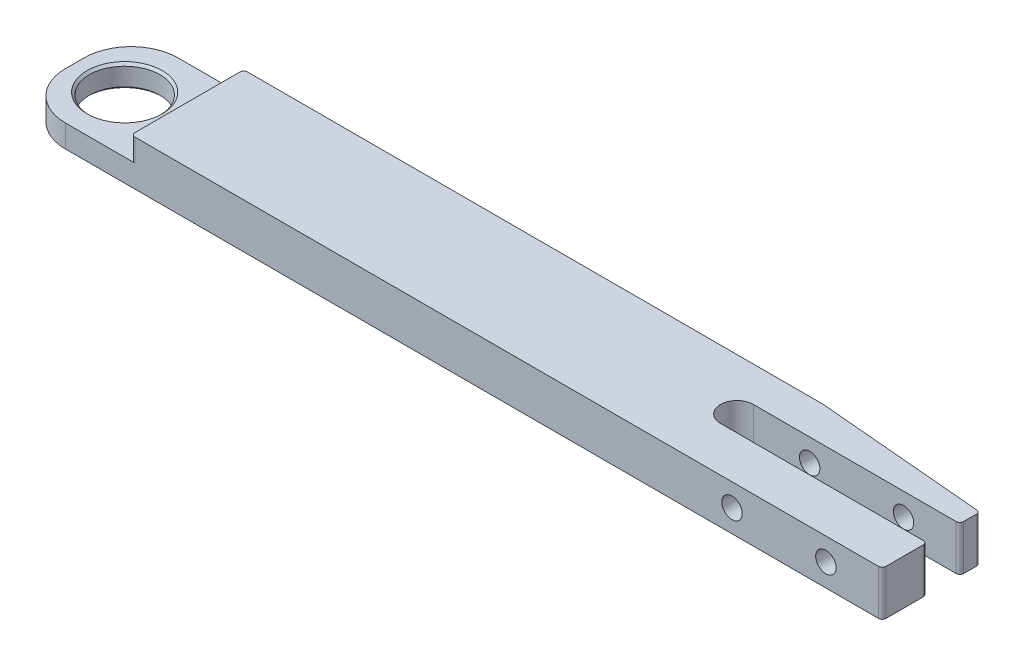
ISO-10303-21;
HEADER;
FILE_DESCRIPTION(('STEP AP214'),'2;1');
FILE_NAME('part.step','',(''),(''),'','','');
FILE_SCHEMA(('AUTOMOTIVE_DESIGN { 1 0 10303 214 1 1 1 1 }'));
ENDSEC;
DATA;
#1=APPLICATION_CONTEXT('core data for automotive mechanical design processes');
#2=APPLICATION_PROTOCOL_DEFINITION('international standard','automotive_design',2000,#1);
#3=PRODUCT_CONTEXT('',#1,'mechanical');
#4=PRODUCT('Part','Part','',(#3));
#5=PRODUCT_RELATED_PRODUCT_CATEGORY('part','',(#4));
#6=PRODUCT_DEFINITION_FORMATION('','',#4);
#7=PRODUCT_DEFINITION_CONTEXT('part definition',#1,'design');
#8=PRODUCT_DEFINITION('design','',#6,#7);
#9=PRODUCT_DEFINITION_SHAPE('','',#8);
#10=(LENGTH_UNIT() NAMED_UNIT(*) SI_UNIT(.MILLI.,.METRE.));
#11=(NAMED_UNIT(*) PLANE_ANGLE_UNIT() SI_UNIT($,.RADIAN.));
#12=(NAMED_UNIT(*) SI_UNIT($,.STERADIAN.) SOLID_ANGLE_UNIT());
#13=UNCERTAINTY_MEASURE_WITH_UNIT(LENGTH_MEASURE(1.E-05),#10,'distance_accuracy_value','');
#14=(GEOMETRIC_REPRESENTATION_CONTEXT(3) GLOBAL_UNCERTAINTY_ASSIGNED_CONTEXT((#13)) GLOBAL_UNIT_ASSIGNED_CONTEXT((#10,
#11,#12)) REPRESENTATION_CONTEXT('',''));
#15=CARTESIAN_POINT('',(0.,0.,0.));
#16=DIRECTION('',(0.,0.,1.));
#17=DIRECTION('',(1.,0.,0.));
#18=AXIS2_PLACEMENT_3D('',#15,#16,#17);
#19=CARTESIAN_POINT('',(73.025,3.81,-9.525));
#20=DIRECTION('',(-1.,0.,0.));
#21=DIRECTION('',(0.,0.,1.));
#22=AXIS2_PLACEMENT_3D('',#19,#20,#21);
#23=PLANE('',#22);
#24=DIRECTION('',(0.,0.,-1.));
#25=VECTOR('',#24,1.);
#26=CARTESIAN_POINT('',(73.025,-3.81,-9.525));
#27=LINE('',#26,#25);
#28=CARTESIAN_POINT('',(73.025,-3.81,8.88999999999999));
#29=VERTEX_POINT('',#28);
#30=CARTESIAN_POINT('',(73.025,-3.81,2.58762500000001));
#31=VERTEX_POINT('',#30);
#32=EDGE_CURVE('E237',#29,#31,#27,.T.);
#33=ORIENTED_EDGE('',*,*,#32,.T.);
#34=DIRECTION('',(0.,-1.,0.));
#35=VECTOR('',#34,1.);
#36=CARTESIAN_POINT('',(73.025,3.81,2.58762500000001));
#37=LINE('',#36,#35);
#38=CARTESIAN_POINT('',(73.025,3.81,2.58762500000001));
#39=VERTEX_POINT('',#38);
#40=EDGE_CURVE('E306',#31,#39,#37,.F.);
#41=ORIENTED_EDGE('',*,*,#40,.T.);
#42=DIRECTION('',(0.,0.,-1.));
#43=VECTOR('',#42,1.);
#44=CARTESIAN_POINT('',(73.025,3.81,-9.525));
#45=LINE('',#44,#43);
#46=CARTESIAN_POINT('',(73.025,3.81,8.88999999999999));
#47=VERTEX_POINT('',#46);
#48=EDGE_CURVE('E226',#47,#39,#45,.T.);
#49=ORIENTED_EDGE('',*,*,#48,.F.);
#50=DIRECTION('',(0.,-1.,0.));
#51=VECTOR('',#50,1.);
#52=CARTESIAN_POINT('',(73.025,3.81,8.89));
#53=LINE('',#52,#51);
#54=EDGE_CURVE('E303',#47,#29,#53,.T.);
#55=ORIENTED_EDGE('',*,*,#54,.T.);
#56=EDGE_LOOP('',(#33,#41,#49,#55));
#57=FACE_BOUND('',#56,.T.);
#58=ADVANCED_FACE('F35',(#57),#23,.F.);
#59=CARTESIAN_POINT('',(-73.025,3.81,-9.525));
#60=DIRECTION('',(1.,0.,0.));
#61=DIRECTION('',(0.,0.,-1.));
#62=AXIS2_PLACEMENT_3D('',#59,#60,#61);
#63=PLANE('',#62);
#64=DIRECTION('',(0.,0.,1.));
#65=VECTOR('',#64,1.);
#66=CARTESIAN_POINT('',(-73.025,-3.81,-9.525));
#67=LINE('',#66,#65);
#68=CARTESIAN_POINT('',(-73.025,-3.81,-1.58750000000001));
#69=VERTEX_POINT('',#68);
#70=CARTESIAN_POINT('',(-73.025,-3.81,1.5875));
#71=VERTEX_POINT('',#70);
#72=EDGE_CURVE('E242',#69,#71,#67,.T.);
#73=ORIENTED_EDGE('',*,*,#72,.T.);
#74=DIRECTION('',(0.,-1.,0.));
#75=VECTOR('',#74,1.);
#76=CARTESIAN_POINT('',(-73.025,3.81,1.5875));
#77=LINE('',#76,#75);
#78=CARTESIAN_POINT('',(-73.025,0.,1.5875));
#79=VERTEX_POINT('',#78);
#80=EDGE_CURVE('E328',#71,#79,#77,.F.);
#81=ORIENTED_EDGE('',*,*,#80,.T.);
#82=DIRECTION('',(0.,0.,-1.));
#83=VECTOR('',#82,1.);
#84=CARTESIAN_POINT('',(-73.025,0.,-9.525));
#85=LINE('',#84,#83);
#86=CARTESIAN_POINT('',(-73.025,0.,-1.5875));
#87=VERTEX_POINT('',#86);
#88=EDGE_CURVE('E218',#79,#87,#85,.T.);
#89=ORIENTED_EDGE('',*,*,#88,.T.);
#90=DIRECTION('',(0.,-1.,0.));
#91=VECTOR('',#90,1.);
#92=CARTESIAN_POINT('',(-73.025,3.81,-1.5875));
#93=LINE('',#92,#91);
#94=EDGE_CURVE('E325',#87,#69,#93,.T.);
#95=ORIENTED_EDGE('',*,*,#94,.T.);
#96=EDGE_LOOP('',(#73,#81,#89,#95));
#97=FACE_BOUND('',#96,.T.);
#98=ADVANCED_FACE('F346',(#97),#63,.F.);
#99=CARTESIAN_POINT('',(73.025,-3.81,-4.238625));
#100=VERTEX_POINT('',#99);
#101=CARTESIAN_POINT('',(73.025,-3.81,-6.40312970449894));
#102=VERTEX_POINT('',#101);
#103=EDGE_CURVE('E225',#100,#102,#27,.T.);
#104=ORIENTED_EDGE('',*,*,#103,.T.);
#105=DIRECTION('',(0.,-1.,0.));
#106=VECTOR('',#105,1.);
#107=CARTESIAN_POINT('',(73.025,3.81,-6.40312970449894));
#108=LINE('',#107,#106);
#109=CARTESIAN_POINT('',(73.025,3.81,-6.40312970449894));
#110=VERTEX_POINT('',#109);
#111=EDGE_CURVE('E265',#102,#110,#108,.F.);
#112=ORIENTED_EDGE('',*,*,#111,.T.);
#113=CARTESIAN_POINT('',(73.025,3.81,-4.238625));
#114=VERTEX_POINT('',#113);
#115=EDGE_CURVE('E230',#114,#110,#45,.T.);
#116=ORIENTED_EDGE('',*,*,#115,.F.);
#117=DIRECTION('',(0.,1.,0.));
#118=VECTOR('',#117,1.);
#119=CARTESIAN_POINT('',(73.025,3.81,-4.238625));
#120=LINE('',#119,#118);
#121=EDGE_CURVE('E254',#114,#100,#120,.F.);
#122=ORIENTED_EDGE('',*,*,#121,.T.);
#123=EDGE_LOOP('',(#104,#112,#116,#122));
#124=FACE_BOUND('',#123,.T.);
#125=ADVANCED_FACE('F366',(#124),#23,.F.);
#126=CARTESIAN_POINT('',(-73.025,3.81,-9.525));
#127=DIRECTION('',(0.,0.,1.));
#128=DIRECTION('',(1.,0.,0.));
#129=AXIS2_PLACEMENT_3D('',#126,#127,#128);
#130=PLANE('',#129);
#131=DIRECTION('',(-1.,0.,0.));
#132=VECTOR('',#131,1.);
#133=CARTESIAN_POINT('',(-73.025,-3.81,-9.525));
#134=LINE('',#133,#132);
#135=CARTESIAN_POINT('',(43.9926671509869,-3.81,-9.525));
#136=VERTEX_POINT('',#135);
#137=CARTESIAN_POINT('',(-65.0875,-3.81,-9.525));
#138=VERTEX_POINT('',#137);
#139=EDGE_CURVE('E240',#136,#138,#134,.T.);
#140=ORIENTED_EDGE('',*,*,#139,.T.);
#141=DIRECTION('',(0.,-1.,0.));
#142=VECTOR('',#141,1.);
#143=CARTESIAN_POINT('',(-65.0875,3.81,-9.525));
#144=LINE('',#143,#142);
#145=CARTESIAN_POINT('',(-65.0875,0.,-9.525));
#146=VERTEX_POINT('',#145);
#147=EDGE_CURVE('E12',#138,#146,#144,.F.);
#148=ORIENTED_EDGE('',*,*,#147,.T.);
#149=DIRECTION('',(1.,0.,0.));
#150=VECTOR('',#149,1.);
#151=CARTESIAN_POINT('',(-73.025,0.,-9.525));
#152=LINE('',#151,#150);
#153=CARTESIAN_POINT('',(-53.34,0.,-9.525));
#154=VERTEX_POINT('',#153);
#155=EDGE_CURVE('E216',#146,#154,#152,.T.);
#156=ORIENTED_EDGE('',*,*,#155,.T.);
#157=DIRECTION('',(0.,1.,0.));
#158=VECTOR('',#157,1.);
#159=CARTESIAN_POINT('',(-53.34,3.81,-9.525));
#160=LINE('',#159,#158);
#161=CARTESIAN_POINT('',(-53.34,3.81,-9.525));
#162=VERTEX_POINT('',#161);
#163=EDGE_CURVE('E291',#154,#162,#160,.T.);
#164=ORIENTED_EDGE('',*,*,#163,.T.);
#165=DIRECTION('',(-1.,0.,0.));
#166=VECTOR('',#165,1.);
#167=CARTESIAN_POINT('',(-53.975,3.81,-9.525));
#168=LINE('',#167,#166);
#169=CARTESIAN_POINT('',(43.9926671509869,3.81,-9.525));
#170=VERTEX_POINT('',#169);
#171=EDGE_CURVE('E229',#170,#162,#168,.T.);
#172=ORIENTED_EDGE('',*,*,#171,.F.);
#173=DIRECTION('',(0.,-1.,0.));
#174=VECTOR('',#173,1.);
#175=CARTESIAN_POINT('',(43.9926671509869,3.81,-9.525));
#176=LINE('',#175,#174);
#177=EDGE_CURVE('E236',#170,#136,#176,.T.);
#178=ORIENTED_EDGE('',*,*,#177,.T.);
#179=EDGE_LOOP('',(#140,#148,#156,#164,#172,#178));
#180=FACE_BOUND('',#179,.T.);
#181=ADVANCED_FACE('F350',(#180),#130,.F.);
#182=CARTESIAN_POINT('',(-73.025,3.81,9.525));
#183=DIRECTION('',(0.,0.,-1.));
#184=DIRECTION('',(-1.,0.,0.));
#185=AXIS2_PLACEMENT_3D('',#182,#183,#184);
#186=PLANE('',#185);
#187=CARTESIAN_POINT('',(63.5,0.,9.525));
#188=DIRECTION('',(0.,0.,-1.));
#189=DIRECTION('',(-1.,0.,0.));
#190=AXIS2_PLACEMENT_3D('',#187,#188,#189);
#191=CIRCLE('',#190,1.7272);
#192=CARTESIAN_POINT('',(61.7728,0.,9.525));
#193=VERTEX_POINT('',#192);
#194=EDGE_CURVE('E393',#193,#193,#191,.T.);
#195=ORIENTED_EDGE('',*,*,#194,.T.);
#196=EDGE_LOOP('',(#195));
#197=FACE_BOUND('',#196,.T.);
#198=CARTESIAN_POINT('',(47.625,0.,9.525));
#199=DIRECTION('',(0.,0.,-1.));
#200=DIRECTION('',(-1.,0.,0.));
#201=AXIS2_PLACEMENT_3D('',#198,#199,#200);
#202=CIRCLE('',#201,1.7272);
#203=CARTESIAN_POINT('',(45.8978,0.,9.525));
#204=VERTEX_POINT('',#203);
#205=EDGE_CURVE('E380',#204,#204,#202,.T.);
#206=ORIENTED_EDGE('',*,*,#205,.T.);
#207=EDGE_LOOP('',(#206));
#208=FACE_BOUND('',#207,.T.);
#209=DIRECTION('',(-1.,0.,0.));
#210=VECTOR('',#209,1.);
#211=CARTESIAN_POINT('',(-73.025,0.,9.525));
#212=LINE('',#211,#210);
#213=CARTESIAN_POINT('',(-53.34,0.,9.525));
#214=VERTEX_POINT('',#213);
#215=CARTESIAN_POINT('',(-65.0875,0.,9.525));
#216=VERTEX_POINT('',#215);
#217=EDGE_CURVE('E220',#214,#216,#212,.T.);
#218=ORIENTED_EDGE('',*,*,#217,.T.);
#219=DIRECTION('',(0.,-1.,0.));
#220=VECTOR('',#219,1.);
#221=CARTESIAN_POINT('',(-65.0875,3.81,9.525));
#222=LINE('',#221,#220);
#223=CARTESIAN_POINT('',(-65.0875,-3.81,9.525));
#224=VERTEX_POINT('',#223);
#225=EDGE_CURVE('E318',#216,#224,#222,.T.);
#226=ORIENTED_EDGE('',*,*,#225,.T.);
#227=DIRECTION('',(1.,0.,0.));
#228=VECTOR('',#227,1.);
#229=CARTESIAN_POINT('',(-73.025,-3.81,9.525));
#230=LINE('',#229,#228);
#231=CARTESIAN_POINT('',(72.39,-3.81,9.525));
#232=VERTEX_POINT('',#231);
#233=EDGE_CURVE('E245',#224,#232,#230,.T.);
#234=ORIENTED_EDGE('',*,*,#233,.T.);
#235=DIRECTION('',(0.,-1.,0.));
#236=VECTOR('',#235,1.);
#237=CARTESIAN_POINT('',(72.39,3.81,9.525));
#238=LINE('',#237,#236);
#239=CARTESIAN_POINT('',(72.39,3.81,9.525));
#240=VERTEX_POINT('',#239);
#241=EDGE_CURVE('E311',#232,#240,#238,.F.);
#242=ORIENTED_EDGE('',*,*,#241,.T.);
#243=DIRECTION('',(1.,0.,0.));
#244=VECTOR('',#243,1.);
#245=CARTESIAN_POINT('',(-73.025,3.81,9.525));
#246=LINE('',#245,#244);
#247=CARTESIAN_POINT('',(-53.34,3.81,9.525));
#248=VERTEX_POINT('',#247);
#249=EDGE_CURVE('E233',#248,#240,#246,.T.);
#250=ORIENTED_EDGE('',*,*,#249,.F.);
#251=DIRECTION('',(0.,1.,0.));
#252=VECTOR('',#251,1.);
#253=CARTESIAN_POINT('',(-53.34,3.81,9.525));
#254=LINE('',#253,#252);
#255=EDGE_CURVE('E308',#248,#214,#254,.F.);
#256=ORIENTED_EDGE('',*,*,#255,.T.);
#257=EDGE_LOOP('',(#218,#226,#234,#242,#250,#256));
#258=FACE_BOUND('',#257,.T.);
#259=ADVANCED_FACE('F336',(#197,#208,#258),#186,.F.);
#260=CARTESIAN_POINT('',(0.,3.81,0.));
#261=DIRECTION('',(0.,1.,0.));
#262=DIRECTION('',(0.,0.,1.));
#263=AXIS2_PLACEMENT_3D('',#260,#261,#262);
#264=PLANE('',#263);
#265=ORIENTED_EDGE('',*,*,#115,.T.);
#266=CARTESIAN_POINT('',(72.39,3.81,-6.40312970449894));
#267=DIRECTION('',(0.,1.,0.));
#268=DIRECTION('',(0.,0.,1.));
#269=AXIS2_PLACEMENT_3D('',#266,#267,#268);
#270=CIRCLE('',#269,0.635);
#271=CARTESIAN_POINT('',(72.4453438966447,3.81,-7.0357133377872));
#272=VERTEX_POINT('',#271);
#273=EDGE_CURVE('E278',#110,#272,#270,.T.);
#274=ORIENTED_EDGE('',*,*,#273,.T.);
#275=DIRECTION('',(0.996194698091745,0.,0.0871557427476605));
#276=VECTOR('',#275,1.);
#277=CARTESIAN_POINT('',(1.16117317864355,3.81,-13.2722701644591));
#278=LINE('',#277,#276);
#279=EDGE_CURVE('E252',#272,#170,#278,.F.);
#280=ORIENTED_EDGE('',*,*,#279,.T.);
#281=ORIENTED_EDGE('',*,*,#171,.T.);
#282=CARTESIAN_POINT('',(-53.34,3.81,-8.89));
#283=DIRECTION('',(0.,1.,0.));
#284=DIRECTION('',(0.,0.,1.));
#285=AXIS2_PLACEMENT_3D('',#282,#283,#284);
#286=CIRCLE('',#285,0.635);
#287=CARTESIAN_POINT('',(-53.975,3.81,-8.89));
#288=VERTEX_POINT('',#287);
#289=EDGE_CURVE('E276',#162,#288,#286,.T.);
#290=ORIENTED_EDGE('',*,*,#289,.T.);
#291=DIRECTION('',(0.,0.,-1.));
#292=VECTOR('',#291,1.);
#293=CARTESIAN_POINT('',(-53.975,3.81,-9.525));
#294=LINE('',#293,#292);
#295=CARTESIAN_POINT('',(-53.975,3.81,8.88999999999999));
#296=VERTEX_POINT('',#295);
#297=EDGE_CURVE('E212',#296,#288,#294,.T.);
#298=ORIENTED_EDGE('',*,*,#297,.F.);
#299=CARTESIAN_POINT('',(-53.34,3.81,8.89));
#300=DIRECTION('',(0.,1.,0.));
#301=DIRECTION('',(0.,0.,1.));
#302=AXIS2_PLACEMENT_3D('',#299,#300,#301);
#303=CIRCLE('',#302,0.635);
#304=EDGE_CURVE('E268',#296,#248,#303,.T.);
#305=ORIENTED_EDGE('',*,*,#304,.T.);
#306=ORIENTED_EDGE('',*,*,#249,.T.);
#307=CARTESIAN_POINT('',(72.39,3.81,8.89));
#308=DIRECTION('',(0.,1.,0.));
#309=DIRECTION('',(0.,0.,1.));
#310=AXIS2_PLACEMENT_3D('',#307,#308,#309);
#311=CIRCLE('',#310,0.635);
#312=EDGE_CURVE('E270',#240,#47,#311,.T.);
#313=ORIENTED_EDGE('',*,*,#312,.T.);
#314=ORIENTED_EDGE('',*,*,#48,.T.);
#315=CARTESIAN_POINT('',(72.39,3.81,2.58762500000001));
#316=DIRECTION('',(0.,1.,0.));
#317=DIRECTION('',(0.,0.,1.));
#318=AXIS2_PLACEMENT_3D('',#315,#316,#317);
#319=CIRCLE('',#318,0.635);
#320=CARTESIAN_POINT('',(72.39,3.81,1.95262500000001));
#321=VERTEX_POINT('',#320);
#322=EDGE_CURVE('E272',#39,#321,#319,.T.);
#323=ORIENTED_EDGE('',*,*,#322,.T.);
#324=DIRECTION('',(1.,0.,0.));
#325=VECTOR('',#324,1.);
#326=CARTESIAN_POINT('',(107.95,3.81,1.95262500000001));
#327=LINE('',#326,#325);
#328=CARTESIAN_POINT('',(38.1,3.81,1.95262500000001));
#329=VERTEX_POINT('',#328);
#330=EDGE_CURVE('E188',#329,#321,#327,.T.);
#331=ORIENTED_EDGE('',*,*,#330,.F.);
#332=CARTESIAN_POINT('',(38.1,3.81,-0.825499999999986));
#333=DIRECTION('',(0.,1.,0.));
#334=DIRECTION('',(0.,0.,1.));
#335=AXIS2_PLACEMENT_3D('',#332,#333,#334);
#336=CIRCLE('',#335,2.77812500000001);
#337=CARTESIAN_POINT('',(38.1,3.81,-3.60362499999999));
#338=VERTEX_POINT('',#337);
#339=EDGE_CURVE('E177',#338,#329,#336,.T.);
#340=ORIENTED_EDGE('',*,*,#339,.F.);
#341=DIRECTION('',(-1.,0.,0.));
#342=VECTOR('',#341,1.);
#343=CARTESIAN_POINT('',(107.95,3.81,-3.603625));
#344=LINE('',#343,#342);
#345=CARTESIAN_POINT('',(72.39,3.81,-3.603625));
#346=VERTEX_POINT('',#345);
#347=EDGE_CURVE('E167',#346,#338,#344,.T.);
#348=ORIENTED_EDGE('',*,*,#347,.F.);
#349=CARTESIAN_POINT('',(72.39,3.81,-4.238625));
#350=DIRECTION('',(0.,1.,0.));
#351=DIRECTION('',(0.,0.,1.));
#352=AXIS2_PLACEMENT_3D('',#349,#350,#351);
#353=CIRCLE('',#352,0.635);
#354=EDGE_CURVE('E274',#346,#114,#353,.T.);
#355=ORIENTED_EDGE('',*,*,#354,.T.);
#356=EDGE_LOOP('',(#265,#274,#280,#281,#290,#298,#305,#306,#313,#314,#323,#331,#340,#348,#355));
#357=FACE_BOUND('',#356,.T.);
#358=ADVANCED_FACE('F191',(#357),#264,.T.);
#359=CARTESIAN_POINT('',(0.,-3.81,0.));
#360=DIRECTION('',(0.,1.,0.));
#361=DIRECTION('',(0.,0.,1.));
#362=AXIS2_PLACEMENT_3D('',#359,#360,#361);
#363=PLANE('',#362);
#364=CARTESIAN_POINT('',(-64.563970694,-3.81,0.0159646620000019));
#365=DIRECTION('',(0.,1.,0.));
#366=DIRECTION('',(0.,0.,1.));
#367=AXIS2_PLACEMENT_3D('',#364,#365,#366);
#368=CIRCLE('',#367,6.35);
#369=CARTESIAN_POINT('',(-64.563970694,-3.81,6.365964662));
#370=VERTEX_POINT('',#369);
#371=EDGE_CURVE('E200',#370,#370,#368,.T.);
#372=ORIENTED_EDGE('',*,*,#371,.T.);
#373=EDGE_LOOP('',(#372));
#374=FACE_BOUND('',#373,.T.);
#375=ORIENTED_EDGE('',*,*,#233,.F.);
#376=CARTESIAN_POINT('',(-65.0875,-3.81,1.5875));
#377=DIRECTION('',(0.,1.,0.));
#378=DIRECTION('',(0.,0.,1.));
#379=AXIS2_PLACEMENT_3D('',#376,#377,#378);
#380=CIRCLE('',#379,7.9375);
#381=EDGE_CURVE('E323',#224,#71,#380,.F.);
#382=ORIENTED_EDGE('',*,*,#381,.T.);
#383=ORIENTED_EDGE('',*,*,#72,.F.);
#384=CARTESIAN_POINT('',(-65.0875,-3.81,-1.5875));
#385=DIRECTION('',(0.,1.,0.));
#386=DIRECTION('',(0.,0.,1.));
#387=AXIS2_PLACEMENT_3D('',#384,#385,#386);
#388=CIRCLE('',#387,7.9375);
#389=EDGE_CURVE('E321',#69,#138,#388,.F.);
#390=ORIENTED_EDGE('',*,*,#389,.T.);
#391=ORIENTED_EDGE('',*,*,#139,.F.);
#392=DIRECTION('',(-0.996194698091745,0.,-0.0871557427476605));
#393=VECTOR('',#392,1.);
#394=CARTESIAN_POINT('',(43.9926671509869,-3.81,-9.525));
#395=LINE('',#394,#393);
#396=CARTESIAN_POINT('',(72.4453438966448,-3.81,-7.03571333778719));
#397=VERTEX_POINT('',#396);
#398=EDGE_CURVE('E249',#136,#397,#395,.F.);
#399=ORIENTED_EDGE('',*,*,#398,.T.);
#400=CARTESIAN_POINT('',(72.39,-3.81,-6.40312970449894));
#401=DIRECTION('',(0.,1.,0.));
#402=DIRECTION('',(0.,0.,1.));
#403=AXIS2_PLACEMENT_3D('',#400,#401,#402);
#404=CIRCLE('',#403,0.635);
#405=EDGE_CURVE('E289',#397,#102,#404,.F.);
#406=ORIENTED_EDGE('',*,*,#405,.T.);
#407=ORIENTED_EDGE('',*,*,#103,.F.);
#408=CARTESIAN_POINT('',(72.39,-3.81,-4.238625));
#409=DIRECTION('',(0.,1.,0.));
#410=DIRECTION('',(0.,0.,1.));
#411=AXIS2_PLACEMENT_3D('',#408,#409,#410);
#412=CIRCLE('',#411,0.635);
#413=CARTESIAN_POINT('',(72.39,-3.81,-3.603625));
#414=VERTEX_POINT('',#413);
#415=EDGE_CURVE('E287',#100,#414,#412,.F.);
#416=ORIENTED_EDGE('',*,*,#415,.T.);
#417=DIRECTION('',(1.,0.,0.));
#418=VECTOR('',#417,1.);
#419=CARTESIAN_POINT('',(107.95,-3.81,-3.603625));
#420=LINE('',#419,#418);
#421=CARTESIAN_POINT('',(38.1,-3.81,-3.603625));
#422=VERTEX_POINT('',#421);
#423=EDGE_CURVE('E197',#422,#414,#420,.T.);
#424=ORIENTED_EDGE('',*,*,#423,.F.);
#425=CARTESIAN_POINT('',(38.1,-3.81,-0.825499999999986));
#426=DIRECTION('',(0.,1.,0.));
#427=DIRECTION('',(0.,0.,1.));
#428=AXIS2_PLACEMENT_3D('',#425,#426,#427);
#429=CIRCLE('',#428,2.77812500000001);
#430=CARTESIAN_POINT('',(38.1,-3.81,1.95262500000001));
#431=VERTEX_POINT('',#430);
#432=EDGE_CURVE('E186',#431,#422,#429,.F.);
#433=ORIENTED_EDGE('',*,*,#432,.F.);
#434=DIRECTION('',(-1.,0.,0.));
#435=VECTOR('',#434,1.);
#436=CARTESIAN_POINT('',(107.95,-3.81,1.95262500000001));
#437=LINE('',#436,#435);
#438=CARTESIAN_POINT('',(72.39,-3.81,1.95262500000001));
#439=VERTEX_POINT('',#438);
#440=EDGE_CURVE('E178',#439,#431,#437,.T.);
#441=ORIENTED_EDGE('',*,*,#440,.F.);
#442=CARTESIAN_POINT('',(72.39,-3.81,2.58762500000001));
#443=DIRECTION('',(0.,1.,0.));
#444=DIRECTION('',(0.,0.,1.));
#445=AXIS2_PLACEMENT_3D('',#442,#443,#444);
#446=CIRCLE('',#445,0.635);
#447=EDGE_CURVE('E285',#439,#31,#446,.F.);
#448=ORIENTED_EDGE('',*,*,#447,.T.);
#449=ORIENTED_EDGE('',*,*,#32,.F.);
#450=CARTESIAN_POINT('',(72.39,-3.81,8.89));
#451=DIRECTION('',(0.,1.,0.));
#452=DIRECTION('',(0.,0.,1.));
#453=AXIS2_PLACEMENT_3D('',#450,#451,#452);
#454=CIRCLE('',#453,0.635);
#455=EDGE_CURVE('E282',#29,#232,#454,.F.);
#456=ORIENTED_EDGE('',*,*,#455,.T.);
#457=EDGE_LOOP('',(#375,#382,#383,#390,#391,#399,#406,#407,#416,#424,#433,#441,#448,#449,#456));
#458=FACE_BOUND('',#457,.T.);
#459=ADVANCED_FACE('F344',(#374,#458),#363,.F.);
#460=CARTESIAN_POINT('',(-53.975,-30.7507683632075,-9.525));
#461=DIRECTION('',(1.,0.,0.));
#462=DIRECTION('',(0.,0.,-1.));
#463=AXIS2_PLACEMENT_3D('',#460,#461,#462);
#464=PLANE('',#463);
#465=ORIENTED_EDGE('',*,*,#297,.T.);
#466=DIRECTION('',(0.,1.,0.));
#467=VECTOR('',#466,1.);
#468=CARTESIAN_POINT('',(-53.975,-30.7507683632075,-8.89));
#469=LINE('',#468,#467);
#470=CARTESIAN_POINT('',(-53.975,0.,-8.89));
#471=VERTEX_POINT('',#470);
#472=EDGE_CURVE('E297',#288,#471,#469,.F.);
#473=ORIENTED_EDGE('',*,*,#472,.T.);
#474=DIRECTION('',(0.,0.,1.));
#475=VECTOR('',#474,1.);
#476=CARTESIAN_POINT('',(-53.975,0.,-9.525));
#477=LINE('',#476,#475);
#478=CARTESIAN_POINT('',(-53.975,0.,8.89));
#479=VERTEX_POINT('',#478);
#480=EDGE_CURVE('E213',#471,#479,#477,.T.);
#481=ORIENTED_EDGE('',*,*,#480,.T.);
#482=DIRECTION('',(0.,1.,0.));
#483=VECTOR('',#482,1.);
#484=CARTESIAN_POINT('',(-53.975,-30.7507683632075,8.89));
#485=LINE('',#484,#483);
#486=EDGE_CURVE('E294',#479,#296,#485,.T.);
#487=ORIENTED_EDGE('',*,*,#486,.T.);
#488=EDGE_LOOP('',(#465,#473,#481,#487));
#489=FACE_BOUND('',#488,.T.);
#490=ADVANCED_FACE('F437',(#489),#464,.F.);
#491=CARTESIAN_POINT('',(0.,0.,0.));
#492=DIRECTION('',(0.,1.,0.));
#493=DIRECTION('',(0.,0.,1.));
#494=AXIS2_PLACEMENT_3D('',#491,#492,#493);
#495=PLANE('',#494);
#496=CARTESIAN_POINT('',(-64.563970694,0.,0.0159646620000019));
#497=DIRECTION('',(0.,1.,0.));
#498=DIRECTION('',(0.,0.,1.));
#499=AXIS2_PLACEMENT_3D('',#496,#497,#498);
#500=CIRCLE('',#499,6.35);
#501=CARTESIAN_POINT('',(-64.563970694,0.,6.365964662));
#502=VERTEX_POINT('',#501);
#503=EDGE_CURVE('E203',#502,#502,#500,.T.);
#504=ORIENTED_EDGE('',*,*,#503,.F.);
#505=EDGE_LOOP('',(#504));
#506=FACE_BOUND('',#505,.T.);
#507=ORIENTED_EDGE('',*,*,#88,.F.);
#508=CARTESIAN_POINT('',(-65.0875,0.,1.5875));
#509=DIRECTION('',(0.,1.,0.));
#510=DIRECTION('',(0.,0.,1.));
#511=AXIS2_PLACEMENT_3D('',#508,#509,#510);
#512=CIRCLE('',#511,7.9375);
#513=EDGE_CURVE('E43',#79,#216,#512,.T.);
#514=ORIENTED_EDGE('',*,*,#513,.T.);
#515=ORIENTED_EDGE('',*,*,#217,.F.);
#516=CARTESIAN_POINT('',(-53.34,0.,8.89));
#517=DIRECTION('',(0.,1.,0.));
#518=DIRECTION('',(0.,0.,1.));
#519=AXIS2_PLACEMENT_3D('',#516,#517,#518);
#520=CIRCLE('',#519,0.635);
#521=EDGE_CURVE('E316',#214,#479,#520,.F.);
#522=ORIENTED_EDGE('',*,*,#521,.T.);
#523=ORIENTED_EDGE('',*,*,#480,.F.);
#524=CARTESIAN_POINT('',(-53.34,0.,-8.89));
#525=DIRECTION('',(0.,1.,0.));
#526=DIRECTION('',(0.,0.,1.));
#527=AXIS2_PLACEMENT_3D('',#524,#525,#526);
#528=CIRCLE('',#527,0.635);
#529=EDGE_CURVE('E313',#471,#154,#528,.F.);
#530=ORIENTED_EDGE('',*,*,#529,.T.);
#531=ORIENTED_EDGE('',*,*,#155,.F.);
#532=CARTESIAN_POINT('',(-65.0875,0.,-1.5875));
#533=DIRECTION('',(0.,1.,0.));
#534=DIRECTION('',(0.,0.,1.));
#535=AXIS2_PLACEMENT_3D('',#532,#533,#534);
#536=CIRCLE('',#535,7.9375);
#537=EDGE_CURVE('E55',#146,#87,#536,.T.);
#538=ORIENTED_EDGE('',*,*,#537,.T.);
#539=EDGE_LOOP('',(#507,#514,#515,#522,#523,#530,#531,#538));
#540=FACE_BOUND('',#539,.T.);
#541=ADVANCED_FACE('F331',(#506,#540),#495,.T.);
#542=CARTESIAN_POINT('',(-64.563970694,-3.413125,0.0159646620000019));
#543=DIRECTION('',(0.,-1.,0.));
#544=DIRECTION('',(0.,0.,-1.));
#545=AXIS2_PLACEMENT_3D('',#542,#543,#544);
#546=CONICAL_SURFACE('',#545,5.953125,0.785398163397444);
#547=ORIENTED_EDGE('',*,*,#371,.F.);
#548=EDGE_LOOP('',(#547));
#549=FACE_BOUND('',#548,.T.);
#550=CARTESIAN_POINT('',(-64.563970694,-3.413125,0.0159646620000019));
#551=DIRECTION('',(0.,1.,0.));
#552=DIRECTION('',(0.,0.,1.));
#553=AXIS2_PLACEMENT_3D('',#550,#551,#552);
#554=CIRCLE('',#553,5.953125);
#555=CARTESIAN_POINT('',(-64.563970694,-3.413125,5.96908966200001));
#556=VERTEX_POINT('',#555);
#557=EDGE_CURVE('E209',#556,#556,#554,.T.);
#558=ORIENTED_EDGE('',*,*,#557,.T.);
#559=EDGE_LOOP('',(#558));
#560=FACE_BOUND('',#559,.T.);
#561=ADVANCED_FACE('F446',(#549,#560),#546,.F.);
#562=CARTESIAN_POINT('',(-64.563970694,0.,0.0159646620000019));
#563=DIRECTION('',(0.,1.,0.));
#564=DIRECTION('',(0.,0.,1.));
#565=AXIS2_PLACEMENT_3D('',#562,#563,#564);
#566=CYLINDRICAL_SURFACE('',#565,5.953125);
#567=ORIENTED_EDGE('',*,*,#557,.F.);
#568=EDGE_LOOP('',(#567));
#569=FACE_BOUND('',#568,.T.);
#570=CARTESIAN_POINT('',(-64.563970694,-0.396874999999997,0.0159646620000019));
#571=DIRECTION('',(0.,1.,0.));
#572=DIRECTION('',(0.,0.,1.));
#573=AXIS2_PLACEMENT_3D('',#570,#571,#572);
#574=CIRCLE('',#573,5.953125);
#575=CARTESIAN_POINT('',(-64.563970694,-0.396874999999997,5.96908966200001));
#576=VERTEX_POINT('',#575);
#577=EDGE_CURVE('E206',#576,#576,#574,.T.);
#578=ORIENTED_EDGE('',*,*,#577,.T.);
#579=EDGE_LOOP('',(#578));
#580=FACE_BOUND('',#579,.T.);
#581=ADVANCED_FACE('F450',(#569,#580),#566,.F.);
#582=CARTESIAN_POINT('',(-64.563970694,0.,0.0159646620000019));
#583=DIRECTION('',(0.,1.,0.));
#584=DIRECTION('',(0.,0.,1.));
#585=AXIS2_PLACEMENT_3D('',#582,#583,#584);
#586=CONICAL_SURFACE('',#585,6.35,0.785398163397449);
#587=ORIENTED_EDGE('',*,*,#577,.F.);
#588=EDGE_LOOP('',(#587));
#589=FACE_BOUND('',#588,.T.);
#590=ORIENTED_EDGE('',*,*,#503,.T.);
#591=EDGE_LOOP('',(#590));
#592=FACE_BOUND('',#591,.T.);
#593=ADVANCED_FACE('F454',(#589,#592),#586,.F.);
#594=CARTESIAN_POINT('',(107.95,-3.811,1.95262500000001));
#595=DIRECTION('',(0.,0.,1.));
#596=DIRECTION('',(1.,0.,0.));
#597=AXIS2_PLACEMENT_3D('',#594,#595,#596);
#598=PLANE('',#597);
#599=CARTESIAN_POINT('',(63.5,0.,1.95262500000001));
#600=DIRECTION('',(0.,0.,1.));
#601=DIRECTION('',(1.,0.,0.));
#602=AXIS2_PLACEMENT_3D('',#599,#600,#601);
#603=CIRCLE('',#602,1.7272);
#604=CARTESIAN_POINT('',(65.2272,0.,1.95262500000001));
#605=VERTEX_POINT('',#604);
#606=EDGE_CURVE('E259',#605,#605,#603,.T.);
#607=ORIENTED_EDGE('',*,*,#606,.T.);
#608=EDGE_LOOP('',(#607));
#609=FACE_BOUND('',#608,.T.);
#610=CARTESIAN_POINT('',(47.625,0.,1.95262500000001));
#611=DIRECTION('',(0.,0.,1.));
#612=DIRECTION('',(1.,0.,0.));
#613=AXIS2_PLACEMENT_3D('',#610,#611,#612);
#614=CIRCLE('',#613,1.7272);
#615=CARTESIAN_POINT('',(49.3522,0.,1.95262500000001));
#616=VERTEX_POINT('',#615);
#617=EDGE_CURVE('E372',#616,#616,#614,.T.);
#618=ORIENTED_EDGE('',*,*,#617,.T.);
#619=EDGE_LOOP('',(#618));
#620=FACE_BOUND('',#619,.T.);
#621=ORIENTED_EDGE('',*,*,#330,.T.);
#622=DIRECTION('',(0.,-1.,0.));
#623=VECTOR('',#622,1.);
#624=CARTESIAN_POINT('',(72.39,-3.811,1.95262500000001));
#625=LINE('',#624,#623);
#626=EDGE_CURVE('E300',#321,#439,#625,.T.);
#627=ORIENTED_EDGE('',*,*,#626,.T.);
#628=ORIENTED_EDGE('',*,*,#440,.T.);
#629=DIRECTION('',(0.,1.,0.));
#630=VECTOR('',#629,1.);
#631=CARTESIAN_POINT('',(38.1,-3.811,1.95262500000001));
#632=LINE('',#631,#630);
#633=EDGE_CURVE('E187',#431,#329,#632,.T.);
#634=ORIENTED_EDGE('',*,*,#633,.T.);
#635=EDGE_LOOP('',(#621,#627,#628,#634));
#636=FACE_BOUND('',#635,.T.);
#637=ADVANCED_FACE('F458',(#609,#620,#636),#598,.F.);
#638=CARTESIAN_POINT('',(38.1,-3.811,-0.825499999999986));
#639=DIRECTION('',(0.,1.,0.));
#640=DIRECTION('',(0.,0.,1.));
#641=AXIS2_PLACEMENT_3D('',#638,#639,#640);
#642=CYLINDRICAL_SURFACE('',#641,2.77812500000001);
#643=ORIENTED_EDGE('',*,*,#432,.T.);
#644=DIRECTION('',(0.,1.,0.));
#645=VECTOR('',#644,1.);
#646=CARTESIAN_POINT('',(38.1,-3.811,-3.60362499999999));
#647=LINE('',#646,#645);
#648=EDGE_CURVE('E171',#422,#338,#647,.T.);
#649=ORIENTED_EDGE('',*,*,#648,.T.);
#650=ORIENTED_EDGE('',*,*,#339,.T.);
#651=ORIENTED_EDGE('',*,*,#633,.F.);
#652=EDGE_LOOP('',(#643,#649,#650,#651));
#653=FACE_BOUND('',#652,.T.);
#654=ADVANCED_FACE('F182',(#653),#642,.F.);
#655=CARTESIAN_POINT('',(107.95,-3.811,-3.603625));
#656=DIRECTION('',(0.,0.,-1.));
#657=DIRECTION('',(-1.,0.,0.));
#658=AXIS2_PLACEMENT_3D('',#655,#656,#657);
#659=PLANE('',#658);
#660=CARTESIAN_POINT('',(63.5,0.,-3.603625));
#661=DIRECTION('',(0.,0.,-1.));
#662=DIRECTION('',(-1.,0.,0.));
#663=AXIS2_PLACEMENT_3D('',#660,#661,#662);
#664=CIRCLE('',#663,1.7272);
#665=CARTESIAN_POINT('',(61.7728,0.,-3.603625));
#666=VERTEX_POINT('',#665);
#667=EDGE_CURVE('E390',#666,#666,#664,.T.);
#668=ORIENTED_EDGE('',*,*,#667,.T.);
#669=EDGE_LOOP('',(#668));
#670=FACE_BOUND('',#669,.T.);
#671=CARTESIAN_POINT('',(47.625,0.,-3.603625));
#672=DIRECTION('',(0.,0.,-1.));
#673=DIRECTION('',(-1.,0.,0.));
#674=AXIS2_PLACEMENT_3D('',#671,#672,#673);
#675=CIRCLE('',#674,1.7272);
#676=CARTESIAN_POINT('',(45.8978,0.,-3.603625));
#677=VERTEX_POINT('',#676);
#678=EDGE_CURVE('E375',#677,#677,#675,.T.);
#679=ORIENTED_EDGE('',*,*,#678,.T.);
#680=EDGE_LOOP('',(#679));
#681=FACE_BOUND('',#680,.T.);
#682=ORIENTED_EDGE('',*,*,#423,.T.);
#683=DIRECTION('',(0.,1.,0.));
#684=VECTOR('',#683,1.);
#685=CARTESIAN_POINT('',(72.39,-3.811,-3.603625));
#686=LINE('',#685,#684);
#687=EDGE_CURVE('E174',#414,#346,#686,.T.);
#688=ORIENTED_EDGE('',*,*,#687,.T.);
#689=ORIENTED_EDGE('',*,*,#347,.T.);
#690=ORIENTED_EDGE('',*,*,#648,.F.);
#691=EDGE_LOOP('',(#682,#688,#689,#690));
#692=FACE_BOUND('',#691,.T.);
#693=ADVANCED_FACE('F170',(#670,#681,#692),#659,.F.);
#694=CARTESIAN_POINT('',(47.625,0.,-9.525));
#695=DIRECTION('',(0.,0.,-1.));
#696=DIRECTION('',(-1.,0.,0.));
#697=AXIS2_PLACEMENT_3D('',#694,#695,#696);
#698=CYLINDRICAL_SURFACE('',#697,1.7272);
#699=ORIENTED_EDGE('',*,*,#205,.F.);
#700=EDGE_LOOP('',(#699));
#701=FACE_BOUND('',#700,.T.);
#702=ORIENTED_EDGE('',*,*,#617,.F.);
#703=EDGE_LOOP('',(#702));
#704=FACE_BOUND('',#703,.T.);
#705=ADVANCED_FACE('F462',(#701,#704),#698,.F.);
#706=CARTESIAN_POINT('',(47.625,0.,-6.35));
#707=DIRECTION('',(0.,0.,-1.));
#708=DIRECTION('',(-1.,0.,0.));
#709=AXIS2_PLACEMENT_3D('',#706,#707,#708);
#710=CIRCLE('',#709,1.7272);
#711=CARTESIAN_POINT('',(45.8978,0.,-6.35));
#712=VERTEX_POINT('',#711);
#713=EDGE_CURVE('E383',#712,#712,#710,.T.);
#714=ORIENTED_EDGE('',*,*,#713,.T.);
#715=EDGE_LOOP('',(#714));
#716=FACE_BOUND('',#715,.T.);
#717=ORIENTED_EDGE('',*,*,#678,.F.);
#718=EDGE_LOOP('',(#717));
#719=FACE_BOUND('',#718,.T.);
#720=ADVANCED_FACE('F471',(#716,#719),#698,.F.);
#721=CARTESIAN_POINT('',(49.3522,0.,-6.35));
#722=DIRECTION('',(0.,0.,1.));
#723=DIRECTION('',(1.,0.,0.));
#724=AXIS2_PLACEMENT_3D('',#721,#722,#723);
#725=PLANE('',#724);
#726=ORIENTED_EDGE('',*,*,#713,.F.);
#727=EDGE_LOOP('',(#726));
#728=FACE_BOUND('',#727,.T.);
#729=CARTESIAN_POINT('',(47.625,0.,-6.35));
#730=DIRECTION('',(0.,0.,-1.));
#731=DIRECTION('',(-1.,0.,0.));
#732=AXIS2_PLACEMENT_3D('',#729,#730,#731);
#733=CIRCLE('',#732,3.37312);
#734=CARTESIAN_POINT('',(44.25188,0.,-6.35));
#735=VERTEX_POINT('',#734);
#736=EDGE_CURVE('E258',#735,#735,#733,.T.);
#737=ORIENTED_EDGE('',*,*,#736,.T.);
#738=EDGE_LOOP('',(#737));
#739=FACE_BOUND('',#738,.T.);
#740=ADVANCED_FACE('F473',(#728,#739),#725,.F.);
#741=CARTESIAN_POINT('',(47.625,0.,-9.525));
#742=DIRECTION('',(0.,0.,-1.));
#743=DIRECTION('',(-1.,0.,0.));
#744=AXIS2_PLACEMENT_3D('',#741,#742,#743);
#745=CYLINDRICAL_SURFACE('',#744,3.37312);
#746=ORIENTED_EDGE('',*,*,#736,.F.);
#747=EDGE_LOOP('',(#746));
#748=FACE_BOUND('',#747,.T.);
#749=CARTESIAN_POINT('',(47.625,0.,-9.20721205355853));
#750=DIRECTION('',(-0.0871557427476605,0.,0.996194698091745));
#751=DIRECTION('',(-0.996194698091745,0.,-0.0871557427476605));
#752=AXIS2_PLACEMENT_3D('',#749,#750,#751);
#753=ELLIPSE('',#752,3.38600477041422,3.37312);
#754=CARTESIAN_POINT('',(44.25188,0.,-9.5023218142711));
#755=VERTEX_POINT('',#754);
#756=EDGE_CURVE('E255',#755,#755,#753,.F.);
#757=ORIENTED_EDGE('',*,*,#756,.T.);
#758=EDGE_LOOP('',(#757));
#759=FACE_BOUND('',#758,.T.);
#760=ADVANCED_FACE('F476',(#748,#759),#745,.F.);
#761=CARTESIAN_POINT('',(63.5,0.,-9.525));
#762=DIRECTION('',(0.,0.,-1.));
#763=DIRECTION('',(-1.,0.,0.));
#764=AXIS2_PLACEMENT_3D('',#761,#762,#763);
#765=CYLINDRICAL_SURFACE('',#764,1.7272);
#766=ORIENTED_EDGE('',*,*,#194,.F.);
#767=EDGE_LOOP('',(#766));
#768=FACE_BOUND('',#767,.T.);
#769=ORIENTED_EDGE('',*,*,#606,.F.);
#770=EDGE_LOOP('',(#769));
#771=FACE_BOUND('',#770,.T.);
#772=ADVANCED_FACE('F480',(#768,#771),#765,.F.);
#773=CARTESIAN_POINT('',(63.5,0.,-6.35));
#774=DIRECTION('',(0.,0.,-1.));
#775=DIRECTION('',(-1.,0.,0.));
#776=AXIS2_PLACEMENT_3D('',#773,#774,#775);
#777=CIRCLE('',#776,1.7272);
#778=CARTESIAN_POINT('',(61.7728,0.,-6.35));
#779=VERTEX_POINT('',#778);
#780=EDGE_CURVE('E396',#779,#779,#777,.T.);
#781=ORIENTED_EDGE('',*,*,#780,.T.);
#782=EDGE_LOOP('',(#781));
#783=FACE_BOUND('',#782,.T.);
#784=ORIENTED_EDGE('',*,*,#667,.F.);
#785=EDGE_LOOP('',(#784));
#786=FACE_BOUND('',#785,.T.);
#787=ADVANCED_FACE('F484',(#783,#786),#765,.F.);
#788=CARTESIAN_POINT('',(65.2272,0.,-6.35));
#789=DIRECTION('',(0.,0.,1.));
#790=DIRECTION('',(1.,0.,0.));
#791=AXIS2_PLACEMENT_3D('',#788,#789,#790);
#792=PLANE('',#791);
#793=ORIENTED_EDGE('',*,*,#780,.F.);
#794=EDGE_LOOP('',(#793));
#795=FACE_BOUND('',#794,.T.);
#796=CARTESIAN_POINT('',(63.5,0.,-6.35));
#797=DIRECTION('',(0.,0.,-1.));
#798=DIRECTION('',(-1.,0.,0.));
#799=AXIS2_PLACEMENT_3D('',#796,#797,#798);
#800=CIRCLE('',#799,3.37311999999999);
#801=CARTESIAN_POINT('',(60.12688,0.,-6.35));
#802=VERTEX_POINT('',#801);
#803=EDGE_CURVE('E263',#802,#802,#800,.T.);
#804=ORIENTED_EDGE('',*,*,#803,.T.);
#805=EDGE_LOOP('',(#804));
#806=FACE_BOUND('',#805,.T.);
#807=ADVANCED_FACE('F402',(#795,#806),#792,.F.);
#808=CARTESIAN_POINT('',(63.5,0.,-9.525));
#809=DIRECTION('',(0.,0.,-1.));
#810=DIRECTION('',(-1.,0.,0.));
#811=AXIS2_PLACEMENT_3D('',#808,#809,#810);
#812=CYLINDRICAL_SURFACE('',#811,3.37312);
#813=ORIENTED_EDGE('',*,*,#803,.F.);
#814=EDGE_LOOP('',(#813));
#815=FACE_BOUND('',#814,.T.);
#816=CARTESIAN_POINT('',(63.5,0.,-7.81832952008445));
#817=DIRECTION('',(-0.0871557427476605,0.,0.996194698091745));
#818=DIRECTION('',(-0.996194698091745,0.,-0.0871557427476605));
#819=AXIS2_PLACEMENT_3D('',#816,#817,#818);
#820=ELLIPSE('',#819,3.38600477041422,3.37312);
#821=CARTESIAN_POINT('',(60.12688,0.,-8.11343928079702));
#822=VERTEX_POINT('',#821);
#823=EDGE_CURVE('E260',#822,#822,#820,.F.);
#824=ORIENTED_EDGE('',*,*,#823,.T.);
#825=EDGE_LOOP('',(#824));
#826=FACE_BOUND('',#825,.T.);
#827=ADVANCED_FACE('F404',(#815,#826),#812,.F.);
#828=CARTESIAN_POINT('',(43.9926671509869,3.81,-9.525));
#829=DIRECTION('',(-0.0871557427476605,0.,0.996194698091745));
#830=DIRECTION('',(0.,-1.,0.));
#831=AXIS2_PLACEMENT_3D('',#828,#829,#830);
#832=PLANE('',#831);
#833=ORIENTED_EDGE('',*,*,#279,.F.);
#834=DIRECTION('',(0.,1.,0.));
#835=VECTOR('',#834,1.);
#836=CARTESIAN_POINT('',(72.4453438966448,-3.81,-7.03571333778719));
#837=LINE('',#836,#835);
#838=EDGE_CURVE('E280',#272,#397,#837,.F.);
#839=ORIENTED_EDGE('',*,*,#838,.T.);
#840=ORIENTED_EDGE('',*,*,#398,.F.);
#841=ORIENTED_EDGE('',*,*,#177,.F.);
#842=EDGE_LOOP('',(#833,#839,#840,#841));
#843=FACE_BOUND('',#842,.T.);
#844=ORIENTED_EDGE('',*,*,#756,.F.);
#845=EDGE_LOOP('',(#844));
#846=FACE_BOUND('',#845,.T.);
#847=ORIENTED_EDGE('',*,*,#823,.F.);
#848=EDGE_LOOP('',(#847));
#849=FACE_BOUND('',#848,.T.);
#850=ADVANCED_FACE('F355',(#843,#846,#849),#832,.F.);
#851=CARTESIAN_POINT('',(72.39,3.81,-6.40312970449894));
#852=DIRECTION('',(0.,1.,0.));
#853=DIRECTION('',(0.,0.,1.));
#854=AXIS2_PLACEMENT_3D('',#851,#852,#853);
#855=CYLINDRICAL_SURFACE('',#854,0.635);
#856=ORIENTED_EDGE('',*,*,#405,.F.);
#857=ORIENTED_EDGE('',*,*,#838,.F.);
#858=ORIENTED_EDGE('',*,*,#273,.F.);
#859=ORIENTED_EDGE('',*,*,#111,.F.);
#860=EDGE_LOOP('',(#856,#857,#858,#859));
#861=FACE_BOUND('',#860,.T.);
#862=ADVANCED_FACE('F363',(#861),#855,.T.);
#863=CARTESIAN_POINT('',(-53.34,3.81,-8.89));
#864=DIRECTION('',(0.,1.,0.));
#865=DIRECTION('',(0.,0.,1.));
#866=AXIS2_PLACEMENT_3D('',#863,#864,#865);
#867=CYLINDRICAL_SURFACE('',#866,0.635);
#868=ORIENTED_EDGE('',*,*,#529,.F.);
#869=ORIENTED_EDGE('',*,*,#472,.F.);
#870=ORIENTED_EDGE('',*,*,#289,.F.);
#871=ORIENTED_EDGE('',*,*,#163,.F.);
#872=EDGE_LOOP('',(#868,#869,#870,#871));
#873=FACE_BOUND('',#872,.T.);
#874=ADVANCED_FACE('F415',(#873),#867,.T.);
#875=CARTESIAN_POINT('',(72.39,-3.811,-4.238625));
#876=DIRECTION('',(0.,1.,0.));
#877=DIRECTION('',(0.,0.,1.));
#878=AXIS2_PLACEMENT_3D('',#875,#876,#877);
#879=CYLINDRICAL_SURFACE('',#878,0.635);
#880=ORIENTED_EDGE('',*,*,#415,.F.);
#881=ORIENTED_EDGE('',*,*,#121,.F.);
#882=ORIENTED_EDGE('',*,*,#354,.F.);
#883=ORIENTED_EDGE('',*,*,#687,.F.);
#884=EDGE_LOOP('',(#880,#881,#882,#883));
#885=FACE_BOUND('',#884,.T.);
#886=ADVANCED_FACE('F370',(#885),#879,.T.);
#887=CARTESIAN_POINT('',(72.39,-3.811,2.58762500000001));
#888=DIRECTION('',(0.,-1.,0.));
#889=DIRECTION('',(0.,0.,-1.));
#890=AXIS2_PLACEMENT_3D('',#887,#888,#889);
#891=CYLINDRICAL_SURFACE('',#890,0.635);
#892=ORIENTED_EDGE('',*,*,#322,.F.);
#893=ORIENTED_EDGE('',*,*,#40,.F.);
#894=ORIENTED_EDGE('',*,*,#447,.F.);
#895=ORIENTED_EDGE('',*,*,#626,.F.);
#896=EDGE_LOOP('',(#892,#893,#894,#895));
#897=FACE_BOUND('',#896,.T.);
#898=ADVANCED_FACE('F562',(#897),#891,.T.);
#899=CARTESIAN_POINT('',(72.39,3.81,8.89));
#900=DIRECTION('',(0.,-1.,0.));
#901=DIRECTION('',(0.,0.,-1.));
#902=AXIS2_PLACEMENT_3D('',#899,#900,#901);
#903=CYLINDRICAL_SURFACE('',#902,0.635);
#904=ORIENTED_EDGE('',*,*,#312,.F.);
#905=ORIENTED_EDGE('',*,*,#241,.F.);
#906=ORIENTED_EDGE('',*,*,#455,.F.);
#907=ORIENTED_EDGE('',*,*,#54,.F.);
#908=EDGE_LOOP('',(#904,#905,#906,#907));
#909=FACE_BOUND('',#908,.T.);
#910=ADVANCED_FACE('F570',(#909),#903,.T.);
#911=CARTESIAN_POINT('',(-53.34,-30.7507683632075,8.89));
#912=DIRECTION('',(0.,1.,0.));
#913=DIRECTION('',(0.,0.,1.));
#914=AXIS2_PLACEMENT_3D('',#911,#912,#913);
#915=CYLINDRICAL_SURFACE('',#914,0.635);
#916=ORIENTED_EDGE('',*,*,#521,.F.);
#917=ORIENTED_EDGE('',*,*,#255,.F.);
#918=ORIENTED_EDGE('',*,*,#304,.F.);
#919=ORIENTED_EDGE('',*,*,#486,.F.);
#920=EDGE_LOOP('',(#916,#917,#918,#919));
#921=FACE_BOUND('',#920,.T.);
#922=ADVANCED_FACE('F579',(#921),#915,.T.);
#923=CARTESIAN_POINT('',(-65.0875,3.81,1.5875));
#924=DIRECTION('',(0.,-1.,0.));
#925=DIRECTION('',(0.,0.,-1.));
#926=AXIS2_PLACEMENT_3D('',#923,#924,#925);
#927=CYLINDRICAL_SURFACE('',#926,7.9375);
#928=ORIENTED_EDGE('',*,*,#513,.F.);
#929=ORIENTED_EDGE('',*,*,#80,.F.);
#930=ORIENTED_EDGE('',*,*,#381,.F.);
#931=ORIENTED_EDGE('',*,*,#225,.F.);
#932=EDGE_LOOP('',(#928,#929,#930,#931));
#933=FACE_BOUND('',#932,.T.);
#934=ADVANCED_FACE('F341',(#933),#927,.T.);
#935=CARTESIAN_POINT('',(-65.0875,3.81,-1.5875));
#936=DIRECTION('',(0.,-1.,0.));
#937=DIRECTION('',(0.,0.,-1.));
#938=AXIS2_PLACEMENT_3D('',#935,#936,#937);
#939=CYLINDRICAL_SURFACE('',#938,7.9375);
#940=ORIENTED_EDGE('',*,*,#537,.F.);
#941=ORIENTED_EDGE('',*,*,#147,.F.);
#942=ORIENTED_EDGE('',*,*,#389,.F.);
#943=ORIENTED_EDGE('',*,*,#94,.F.);
#944=EDGE_LOOP('',(#940,#941,#942,#943));
#945=FACE_BOUND('',#944,.T.);
#946=ADVANCED_FACE('F37',(#945),#939,.T.);
#947=CLOSED_SHELL('',(#58,#98,#125,#181,#259,#358,#459,#490,#541,#561,#581,#593,#637,#654,#693,
#705,#720,#740,#760,#772,#787,#807,#827,#850,#862,#874,#886,#898,#910,#922,#934,#946));
#948=MANIFOLD_SOLID_BREP('B2',#947);
#949=ADVANCED_BREP_SHAPE_REPRESENTATION('',(#18,#948),#14);
#950=SHAPE_DEFINITION_REPRESENTATION(#9,#949);
ENDSEC;
END-ISO-10303-21;
